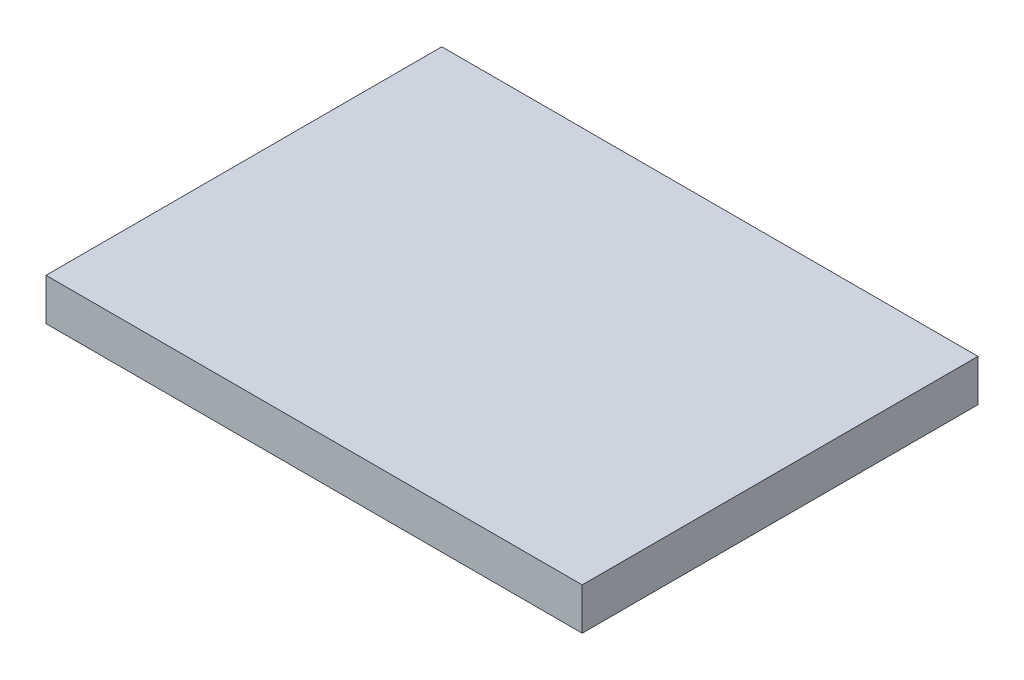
from build123d import *

# Parameters (mm, degrees)
SKETCH1_W           = 64
SKETCH1_H           = 47.244
BOSS_EXTRUDE1_DEPTH = 5


with BuildPart() as part:
    # Sketch1 → Boss-Extrude1 (new body)
    with BuildSketch(Plane(origin=(0, 0, 0), x_dir=(1, 0, 0), z_dir=(0, 1, 0))):
        Rectangle(SKETCH1_W, SKETCH1_H)
    extrude(amount=BOSS_EXTRUDE1_DEPTH)


solid = part.part
